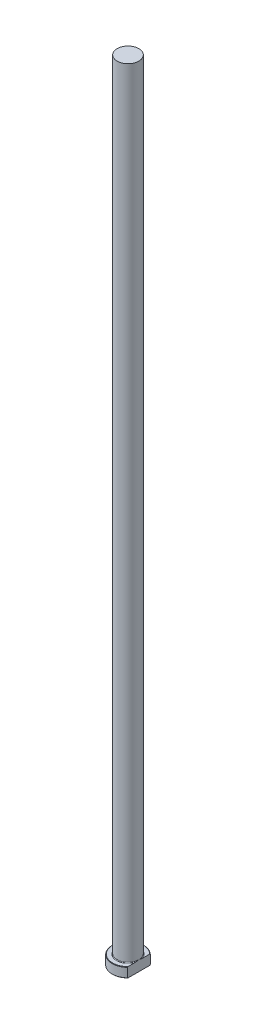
from build123d import *
from build123d.topology import SkipClean

# Parameters (mm, degrees)
CHAMFER1_SIZE = 0.2
FILLET1_R     = 0.3
KEY_DEPTH     = 401.159968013


with BuildPart() as part:
    # Sketch1 → Revolve1 (revolve)
    with BuildSketch(Plane.XY, mode=Mode.PRIVATE) as revolve1_sk:
        Polygon((0, 0), (-8, 0), (-8, 5), (-5.5, 5), (-5.5, 400), (0, 400), align=None)
    revolve(revolve1_sk.sketch.rotate(Axis((0, 259.958771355, 0), (0, -1, 0)), 270), axis=Axis((0, 259.958771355, 0), (0, -1, 0)))

    # Chamfer1
    chamfer1_edges = [part.edges().sort_by_distance(p)[0] for p in [
        (0, 5, -8),
        (0, 0, -8),
    ]]
    chamfer(chamfer1_edges, length=CHAMFER1_SIZE)

    # Fillet1
    fillet1_edges = [part.edges().sort_by_distance(p)[0] for p in [
        (0, 5, -5.5),
    ]]
    fillet(fillet1_edges, radius=FILLET1_R)

    # Sketch2 → KEY (cut, through all)
    with SkipClean():  # the faces are left unmerged after this step: merging them gives an invalid solid
        with BuildSketch(Plane(origin=(0, 0, 0), x_dir=(1, 0, 0), z_dir=(0, 1, 0))):
            with BuildLine():
                Line((5.5, 5.809475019), (5.5, -5.809475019))
                ThreePointArc((5.5, -5.809475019), (8, 0), (5.5, 5.809475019))
            make_face()
        extrude(amount=KEY_DEPTH, mode=Mode.SUBTRACT)


solid = part.part
